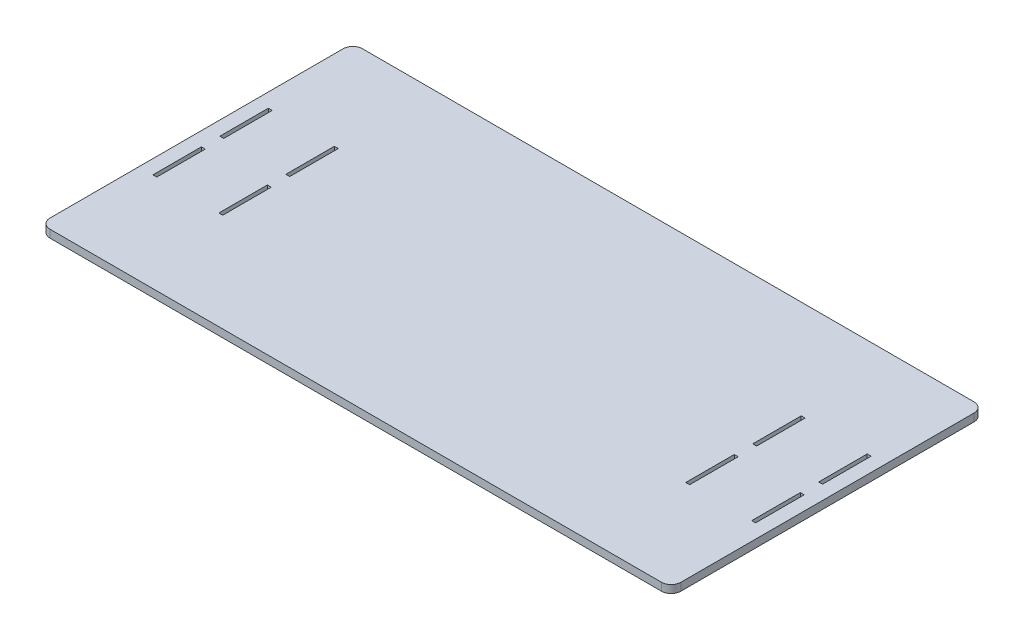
ISO-10303-21;
HEADER;
FILE_DESCRIPTION(('STEP AP214'),'2;1');
FILE_NAME('part.step','',(''),(''),'','','');
FILE_SCHEMA(('AUTOMOTIVE_DESIGN { 1 0 10303 214 1 1 1 1 }'));
ENDSEC;
DATA;
#1=APPLICATION_CONTEXT('core data for automotive mechanical design processes');
#2=APPLICATION_PROTOCOL_DEFINITION('international standard','automotive_design',2000,#1);
#3=PRODUCT_CONTEXT('',#1,'mechanical');
#4=PRODUCT('Part','Part','',(#3));
#5=PRODUCT_RELATED_PRODUCT_CATEGORY('part','',(#4));
#6=PRODUCT_DEFINITION_FORMATION('','',#4);
#7=PRODUCT_DEFINITION_CONTEXT('part definition',#1,'design');
#8=PRODUCT_DEFINITION('design','',#6,#7);
#9=PRODUCT_DEFINITION_SHAPE('','',#8);
#10=(LENGTH_UNIT() NAMED_UNIT(*) SI_UNIT(.MILLI.,.METRE.));
#11=(NAMED_UNIT(*) PLANE_ANGLE_UNIT() SI_UNIT($,.RADIAN.));
#12=(NAMED_UNIT(*) SI_UNIT($,.STERADIAN.) SOLID_ANGLE_UNIT());
#13=UNCERTAINTY_MEASURE_WITH_UNIT(LENGTH_MEASURE(1.E-05),#10,'distance_accuracy_value','');
#14=(GEOMETRIC_REPRESENTATION_CONTEXT(3) GLOBAL_UNCERTAINTY_ASSIGNED_CONTEXT((#13)) GLOBAL_UNIT_ASSIGNED_CONTEXT((#10,
#11,#12)) REPRESENTATION_CONTEXT('',''));
#15=CARTESIAN_POINT('',(0.,0.,0.));
#16=DIRECTION('',(0.,0.,1.));
#17=DIRECTION('',(1.,0.,0.));
#18=AXIS2_PLACEMENT_3D('',#15,#16,#17);
#19=CARTESIAN_POINT('',(-315.,8.,151.));
#20=DIRECTION('',(0.,1.,0.));
#21=DIRECTION('',(0.,0.,1.));
#22=AXIS2_PLACEMENT_3D('',#19,#20,#21);
#23=PLANE('',#22);
#24=CARTESIAN_POINT('',(-315.,8.,151.));
#25=DIRECTION('',(0.,1.,0.));
#26=DIRECTION('',(0.,0.,1.));
#27=AXIS2_PLACEMENT_3D('',#24,#25,#26);
#28=CIRCLE('',#27,10.);
#29=CARTESIAN_POINT('',(-325.,8.,151.));
#30=VERTEX_POINT('',#29);
#31=CARTESIAN_POINT('',(-315.,8.,161.));
#32=VERTEX_POINT('',#31);
#33=EDGE_CURVE('E543',#30,#32,#28,.T.);
#34=ORIENTED_EDGE('',*,*,#33,.T.);
#35=DIRECTION('',(1.,0.,0.));
#36=VECTOR('',#35,1.);
#37=CARTESIAN_POINT('',(-315.,8.,161.));
#38=LINE('',#37,#36);
#39=CARTESIAN_POINT('',(315.,8.,161.));
#40=VERTEX_POINT('',#39);
#41=EDGE_CURVE('E546',#32,#40,#38,.T.);
#42=ORIENTED_EDGE('',*,*,#41,.T.);
#43=CARTESIAN_POINT('',(315.,8.,151.));
#44=DIRECTION('',(0.,1.,0.));
#45=DIRECTION('',(0.,0.,1.));
#46=AXIS2_PLACEMENT_3D('',#43,#44,#45);
#47=CIRCLE('',#46,10.);
#48=CARTESIAN_POINT('',(325.,8.,151.));
#49=VERTEX_POINT('',#48);
#50=EDGE_CURVE('E549',#40,#49,#47,.T.);
#51=ORIENTED_EDGE('',*,*,#50,.T.);
#52=DIRECTION('',(0.,0.,-1.));
#53=VECTOR('',#52,1.);
#54=CARTESIAN_POINT('',(325.,8.,-151.));
#55=LINE('',#54,#53);
#56=CARTESIAN_POINT('',(325.,8.,-151.));
#57=VERTEX_POINT('',#56);
#58=EDGE_CURVE('E551',#49,#57,#55,.T.);
#59=ORIENTED_EDGE('',*,*,#58,.T.);
#60=CARTESIAN_POINT('',(315.,8.,-151.));
#61=DIRECTION('',(0.,1.,0.));
#62=DIRECTION('',(0.,0.,-1.));
#63=AXIS2_PLACEMENT_3D('',#60,#61,#62);
#64=CIRCLE('',#63,10.);
#65=CARTESIAN_POINT('',(315.,8.,-161.));
#66=VERTEX_POINT('',#65);
#67=EDGE_CURVE('E553',#57,#66,#64,.T.);
#68=ORIENTED_EDGE('',*,*,#67,.T.);
#69=DIRECTION('',(-1.,0.,0.));
#70=VECTOR('',#69,1.);
#71=CARTESIAN_POINT('',(-315.,8.,-161.));
#72=LINE('',#71,#70);
#73=CARTESIAN_POINT('',(-315.,8.,-161.));
#74=VERTEX_POINT('',#73);
#75=EDGE_CURVE('E555',#66,#74,#72,.T.);
#76=ORIENTED_EDGE('',*,*,#75,.T.);
#77=CARTESIAN_POINT('',(-315.,8.,-151.));
#78=DIRECTION('',(0.,1.,0.));
#79=DIRECTION('',(0.,0.,1.));
#80=AXIS2_PLACEMENT_3D('',#77,#78,#79);
#81=CIRCLE('',#80,10.);
#82=CARTESIAN_POINT('',(-325.,8.,-151.));
#83=VERTEX_POINT('',#82);
#84=EDGE_CURVE('E557',#74,#83,#81,.T.);
#85=ORIENTED_EDGE('',*,*,#84,.T.);
#86=DIRECTION('',(0.,0.,1.));
#87=VECTOR('',#86,1.);
#88=CARTESIAN_POINT('',(-325.,8.,-151.));
#89=LINE('',#88,#87);
#90=EDGE_CURVE('E559',#83,#30,#89,.T.);
#91=ORIENTED_EDGE('',*,*,#90,.T.);
#92=EDGE_LOOP('',(#34,#42,#51,#59,#68,#76,#85,#91));
#93=FACE_BOUND('',#92,.T.);
#94=DIRECTION('',(1.,0.,0.));
#95=VECTOR('',#94,1.);
#96=CARTESIAN_POINT('',(-310.5,8.,-9.5));
#97=LINE('',#96,#95);
#98=CARTESIAN_POINT('',(-310.5,8.,-9.5));
#99=VERTEX_POINT('',#98);
#100=CARTESIAN_POINT('',(-306.5,8.,-9.5));
#101=VERTEX_POINT('',#100);
#102=EDGE_CURVE('E514',#99,#101,#97,.T.);
#103=ORIENTED_EDGE('',*,*,#102,.F.);
#104=DIRECTION('',(0.,0.,1.));
#105=VECTOR('',#104,1.);
#106=CARTESIAN_POINT('',(-310.5,8.,-9.5));
#107=LINE('',#106,#105);
#108=CARTESIAN_POINT('',(-310.5,8.,-59.5));
#109=VERTEX_POINT('',#108);
#110=EDGE_CURVE('E512',#109,#99,#107,.T.);
#111=ORIENTED_EDGE('',*,*,#110,.F.);
#112=DIRECTION('',(-1.,0.,0.));
#113=VECTOR('',#112,1.);
#114=CARTESIAN_POINT('',(-310.5,8.,-59.5));
#115=LINE('',#114,#113);
#116=CARTESIAN_POINT('',(-306.5,8.,-59.5));
#117=VERTEX_POINT('',#116);
#118=EDGE_CURVE('E520',#117,#109,#115,.T.);
#119=ORIENTED_EDGE('',*,*,#118,.F.);
#120=DIRECTION('',(0.,0.,-1.));
#121=VECTOR('',#120,1.);
#122=CARTESIAN_POINT('',(-306.5,8.,-9.5));
#123=LINE('',#122,#121);
#124=EDGE_CURVE('E517',#101,#117,#123,.T.);
#125=ORIENTED_EDGE('',*,*,#124,.F.);
#126=EDGE_LOOP('',(#103,#111,#119,#125));
#127=FACE_BOUND('',#126,.T.);
#128=DIRECTION('',(0.,0.,-1.));
#129=VECTOR('',#128,1.);
#130=CARTESIAN_POINT('',(-238.5,8.,-9.50000000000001));
#131=LINE('',#130,#129);
#132=CARTESIAN_POINT('',(-238.5,8.,-9.50000000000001));
#133=VERTEX_POINT('',#132);
#134=CARTESIAN_POINT('',(-238.5,8.,-59.5));
#135=VERTEX_POINT('',#134);
#136=EDGE_CURVE('E483',#133,#135,#131,.T.);
#137=ORIENTED_EDGE('',*,*,#136,.F.);
#138=DIRECTION('',(1.,0.,0.));
#139=VECTOR('',#138,1.);
#140=CARTESIAN_POINT('',(-238.5,8.,-9.50000000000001));
#141=LINE('',#140,#139);
#142=CARTESIAN_POINT('',(-242.5,8.,-9.50000000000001));
#143=VERTEX_POINT('',#142);
#144=EDGE_CURVE('E481',#143,#133,#141,.T.);
#145=ORIENTED_EDGE('',*,*,#144,.F.);
#146=DIRECTION('',(0.,0.,1.));
#147=VECTOR('',#146,1.);
#148=CARTESIAN_POINT('',(-242.5,8.,-9.50000000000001));
#149=LINE('',#148,#147);
#150=CARTESIAN_POINT('',(-242.5,8.,-59.5));
#151=VERTEX_POINT('',#150);
#152=EDGE_CURVE('E489',#151,#143,#149,.T.);
#153=ORIENTED_EDGE('',*,*,#152,.F.);
#154=DIRECTION('',(-1.,0.,0.));
#155=VECTOR('',#154,1.);
#156=CARTESIAN_POINT('',(-238.5,8.,-59.5));
#157=LINE('',#156,#155);
#158=EDGE_CURVE('E486',#135,#151,#157,.T.);
#159=ORIENTED_EDGE('',*,*,#158,.F.);
#160=EDGE_LOOP('',(#137,#145,#153,#159));
#161=FACE_BOUND('',#160,.T.);
#162=DIRECTION('',(-1.,0.,0.));
#163=VECTOR('',#162,1.);
#164=CARTESIAN_POINT('',(-238.5,8.,9.50000000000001));
#165=LINE('',#164,#163);
#166=CARTESIAN_POINT('',(-238.5,8.,9.50000000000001));
#167=VERTEX_POINT('',#166);
#168=CARTESIAN_POINT('',(-242.5,8.,9.50000000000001));
#169=VERTEX_POINT('',#168);
#170=EDGE_CURVE('E452',#167,#169,#165,.T.);
#171=ORIENTED_EDGE('',*,*,#170,.F.);
#172=DIRECTION('',(0.,0.,-1.));
#173=VECTOR('',#172,1.);
#174=CARTESIAN_POINT('',(-238.5,8.,9.50000000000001));
#175=LINE('',#174,#173);
#176=CARTESIAN_POINT('',(-238.5,8.,59.5));
#177=VERTEX_POINT('',#176);
#178=EDGE_CURVE('E450',#177,#167,#175,.T.);
#179=ORIENTED_EDGE('',*,*,#178,.F.);
#180=DIRECTION('',(1.,0.,0.));
#181=VECTOR('',#180,1.);
#182=CARTESIAN_POINT('',(-238.5,8.,59.5));
#183=LINE('',#182,#181);
#184=CARTESIAN_POINT('',(-242.5,8.,59.5));
#185=VERTEX_POINT('',#184);
#186=EDGE_CURVE('E458',#185,#177,#183,.T.);
#187=ORIENTED_EDGE('',*,*,#186,.F.);
#188=DIRECTION('',(0.,0.,1.));
#189=VECTOR('',#188,1.);
#190=CARTESIAN_POINT('',(-242.5,8.,9.50000000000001));
#191=LINE('',#190,#189);
#192=EDGE_CURVE('E455',#169,#185,#191,.T.);
#193=ORIENTED_EDGE('',*,*,#192,.F.);
#194=EDGE_LOOP('',(#171,#179,#187,#193));
#195=FACE_BOUND('',#194,.T.);
#196=DIRECTION('',(0.,0.,1.));
#197=VECTOR('',#196,1.);
#198=CARTESIAN_POINT('',(-310.5,8.,9.50000000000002));
#199=LINE('',#198,#197);
#200=CARTESIAN_POINT('',(-310.5,8.,9.50000000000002));
#201=VERTEX_POINT('',#200);
#202=CARTESIAN_POINT('',(-310.5,8.,59.5));
#203=VERTEX_POINT('',#202);
#204=EDGE_CURVE('E421',#201,#203,#199,.T.);
#205=ORIENTED_EDGE('',*,*,#204,.F.);
#206=DIRECTION('',(-1.,0.,0.));
#207=VECTOR('',#206,1.);
#208=CARTESIAN_POINT('',(-310.5,8.,9.50000000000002));
#209=LINE('',#208,#207);
#210=CARTESIAN_POINT('',(-306.5,8.,9.50000000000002));
#211=VERTEX_POINT('',#210);
#212=EDGE_CURVE('E419',#211,#201,#209,.T.);
#213=ORIENTED_EDGE('',*,*,#212,.F.);
#214=DIRECTION('',(0.,0.,-1.));
#215=VECTOR('',#214,1.);
#216=CARTESIAN_POINT('',(-306.5,8.,9.50000000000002));
#217=LINE('',#216,#215);
#218=CARTESIAN_POINT('',(-306.5,8.,59.5));
#219=VERTEX_POINT('',#218);
#220=EDGE_CURVE('E427',#219,#211,#217,.T.);
#221=ORIENTED_EDGE('',*,*,#220,.F.);
#222=DIRECTION('',(1.,0.,0.));
#223=VECTOR('',#222,1.);
#224=CARTESIAN_POINT('',(-310.5,8.,59.5));
#225=LINE('',#224,#223);
#226=EDGE_CURVE('E424',#203,#219,#225,.T.);
#227=ORIENTED_EDGE('',*,*,#226,.F.);
#228=EDGE_LOOP('',(#205,#213,#221,#227));
#229=FACE_BOUND('',#228,.T.);
#230=DIRECTION('',(-1.,0.,0.));
#231=VECTOR('',#230,1.);
#232=CARTESIAN_POINT('',(310.5,8.,9.49999999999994));
#233=LINE('',#232,#231);
#234=CARTESIAN_POINT('',(310.5,8.,9.49999999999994));
#235=VERTEX_POINT('',#234);
#236=CARTESIAN_POINT('',(306.5,8.,9.49999999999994));
#237=VERTEX_POINT('',#236);
#238=EDGE_CURVE('E390',#235,#237,#233,.T.);
#239=ORIENTED_EDGE('',*,*,#238,.F.);
#240=DIRECTION('',(0.,0.,-1.));
#241=VECTOR('',#240,1.);
#242=CARTESIAN_POINT('',(310.5,8.,9.49999999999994));
#243=LINE('',#242,#241);
#244=CARTESIAN_POINT('',(310.5,8.,59.4999999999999));
#245=VERTEX_POINT('',#244);
#246=EDGE_CURVE('E388',#245,#235,#243,.T.);
#247=ORIENTED_EDGE('',*,*,#246,.F.);
#248=DIRECTION('',(1.,0.,0.));
#249=VECTOR('',#248,1.);
#250=CARTESIAN_POINT('',(310.5,8.,59.4999999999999));
#251=LINE('',#250,#249);
#252=CARTESIAN_POINT('',(306.5,8.,59.4999999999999));
#253=VERTEX_POINT('',#252);
#254=EDGE_CURVE('E396',#253,#245,#251,.T.);
#255=ORIENTED_EDGE('',*,*,#254,.F.);
#256=DIRECTION('',(0.,0.,1.));
#257=VECTOR('',#256,1.);
#258=CARTESIAN_POINT('',(306.5,8.,9.49999999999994));
#259=LINE('',#258,#257);
#260=EDGE_CURVE('E393',#237,#253,#259,.T.);
#261=ORIENTED_EDGE('',*,*,#260,.F.);
#262=EDGE_LOOP('',(#239,#247,#255,#261));
#263=FACE_BOUND('',#262,.T.);
#264=DIRECTION('',(0.,0.,1.));
#265=VECTOR('',#264,1.);
#266=CARTESIAN_POINT('',(238.5,8.,9.49999999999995));
#267=LINE('',#266,#265);
#268=CARTESIAN_POINT('',(238.5,8.,9.49999999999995));
#269=VERTEX_POINT('',#268);
#270=CARTESIAN_POINT('',(238.5,8.,59.5));
#271=VERTEX_POINT('',#270);
#272=EDGE_CURVE('E359',#269,#271,#267,.T.);
#273=ORIENTED_EDGE('',*,*,#272,.F.);
#274=DIRECTION('',(-1.,0.,0.));
#275=VECTOR('',#274,1.);
#276=CARTESIAN_POINT('',(238.5,8.,9.49999999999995));
#277=LINE('',#276,#275);
#278=CARTESIAN_POINT('',(242.5,8.,9.49999999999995));
#279=VERTEX_POINT('',#278);
#280=EDGE_CURVE('E357',#279,#269,#277,.T.);
#281=ORIENTED_EDGE('',*,*,#280,.F.);
#282=DIRECTION('',(0.,0.,-1.));
#283=VECTOR('',#282,1.);
#284=CARTESIAN_POINT('',(242.5,8.,9.49999999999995));
#285=LINE('',#284,#283);
#286=CARTESIAN_POINT('',(242.5,8.,59.4999999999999));
#287=VERTEX_POINT('',#286);
#288=EDGE_CURVE('E365',#287,#279,#285,.T.);
#289=ORIENTED_EDGE('',*,*,#288,.F.);
#290=DIRECTION('',(1.,0.,0.));
#291=VECTOR('',#290,1.);
#292=CARTESIAN_POINT('',(238.5,8.,59.5));
#293=LINE('',#292,#291);
#294=EDGE_CURVE('E362',#271,#287,#293,.T.);
#295=ORIENTED_EDGE('',*,*,#294,.F.);
#296=EDGE_LOOP('',(#273,#281,#289,#295));
#297=FACE_BOUND('',#296,.T.);
#298=DIRECTION('',(1.,0.,0.));
#299=VECTOR('',#298,1.);
#300=CARTESIAN_POINT('',(238.5,8.,-9.49999999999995));
#301=LINE('',#300,#299);
#302=CARTESIAN_POINT('',(238.5,8.,-9.49999999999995));
#303=VERTEX_POINT('',#302);
#304=CARTESIAN_POINT('',(242.5,8.,-9.49999999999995));
#305=VERTEX_POINT('',#304);
#306=EDGE_CURVE('E328',#303,#305,#301,.T.);
#307=ORIENTED_EDGE('',*,*,#306,.F.);
#308=DIRECTION('',(0.,0.,1.));
#309=VECTOR('',#308,1.);
#310=CARTESIAN_POINT('',(238.5,8.,-9.49999999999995));
#311=LINE('',#310,#309);
#312=CARTESIAN_POINT('',(238.5,8.,-59.5));
#313=VERTEX_POINT('',#312);
#314=EDGE_CURVE('E326',#313,#303,#311,.T.);
#315=ORIENTED_EDGE('',*,*,#314,.F.);
#316=DIRECTION('',(-1.,0.,0.));
#317=VECTOR('',#316,1.);
#318=CARTESIAN_POINT('',(238.5,8.,-59.5));
#319=LINE('',#318,#317);
#320=CARTESIAN_POINT('',(242.5,8.,-59.5));
#321=VERTEX_POINT('',#320);
#322=EDGE_CURVE('E334',#321,#313,#319,.T.);
#323=ORIENTED_EDGE('',*,*,#322,.F.);
#324=DIRECTION('',(0.,0.,-1.));
#325=VECTOR('',#324,1.);
#326=CARTESIAN_POINT('',(242.5,8.,-9.49999999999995));
#327=LINE('',#326,#325);
#328=EDGE_CURVE('E331',#305,#321,#327,.T.);
#329=ORIENTED_EDGE('',*,*,#328,.F.);
#330=EDGE_LOOP('',(#307,#315,#323,#329));
#331=FACE_BOUND('',#330,.T.);
#332=DIRECTION('',(0.,0.,-1.));
#333=VECTOR('',#332,1.);
#334=CARTESIAN_POINT('',(310.5,8.,-9.49999999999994));
#335=LINE('',#334,#333);
#336=CARTESIAN_POINT('',(310.5,8.,-9.49999999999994));
#337=VERTEX_POINT('',#336);
#338=CARTESIAN_POINT('',(310.5,8.,-59.4999999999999));
#339=VERTEX_POINT('',#338);
#340=EDGE_CURVE('E298',#337,#339,#335,.T.);
#341=ORIENTED_EDGE('',*,*,#340,.F.);
#342=DIRECTION('',(1.,0.,0.));
#343=VECTOR('',#342,1.);
#344=CARTESIAN_POINT('',(310.5,8.,-9.49999999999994));
#345=LINE('',#344,#343);
#346=CARTESIAN_POINT('',(306.5,8.,-9.49999999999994));
#347=VERTEX_POINT('',#346);
#348=EDGE_CURVE('E290',#347,#337,#345,.T.);
#349=ORIENTED_EDGE('',*,*,#348,.F.);
#350=DIRECTION('',(0.,0.,1.));
#351=VECTOR('',#350,1.);
#352=CARTESIAN_POINT('',(306.5,8.,-9.49999999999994));
#353=LINE('',#352,#351);
#354=CARTESIAN_POINT('',(306.5,8.,-59.4999999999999));
#355=VERTEX_POINT('',#354);
#356=EDGE_CURVE('E312',#355,#347,#353,.T.);
#357=ORIENTED_EDGE('',*,*,#356,.F.);
#358=DIRECTION('',(-1.,0.,0.));
#359=VECTOR('',#358,1.);
#360=CARTESIAN_POINT('',(310.5,8.,-59.4999999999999));
#361=LINE('',#360,#359);
#362=EDGE_CURVE('E310',#339,#355,#361,.T.);
#363=ORIENTED_EDGE('',*,*,#362,.F.);
#364=EDGE_LOOP('',(#341,#349,#357,#363));
#365=FACE_BOUND('',#364,.T.);
#366=ADVANCED_FACE('F33',(#93,#127,#161,#195,#229,#263,#297,#331,#365),#23,.T.);
#367=CARTESIAN_POINT('',(-315.,0.,151.));
#368=DIRECTION('',(0.,1.,0.));
#369=DIRECTION('',(0.,0.,1.));
#370=AXIS2_PLACEMENT_3D('',#367,#368,#369);
#371=PLANE('',#370);
#372=DIRECTION('',(0.,0.,1.));
#373=VECTOR('',#372,1.);
#374=CARTESIAN_POINT('',(238.5,0.,-9.49999999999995));
#375=LINE('',#374,#373);
#376=CARTESIAN_POINT('',(238.5,0.,-59.5));
#377=VERTEX_POINT('',#376);
#378=CARTESIAN_POINT('',(238.5,0.,-9.49999999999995));
#379=VERTEX_POINT('',#378);
#380=EDGE_CURVE('E306',#377,#379,#375,.T.);
#381=ORIENTED_EDGE('',*,*,#380,.T.);
#382=DIRECTION('',(1.,0.,0.));
#383=VECTOR('',#382,1.);
#384=CARTESIAN_POINT('',(238.5,0.,-9.49999999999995));
#385=LINE('',#384,#383);
#386=CARTESIAN_POINT('',(242.5,0.,-9.49999999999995));
#387=VERTEX_POINT('',#386);
#388=EDGE_CURVE('E339',#379,#387,#385,.T.);
#389=ORIENTED_EDGE('',*,*,#388,.T.);
#390=DIRECTION('',(0.,0.,-1.));
#391=VECTOR('',#390,1.);
#392=CARTESIAN_POINT('',(242.5,0.,-9.49999999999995));
#393=LINE('',#392,#391);
#394=CARTESIAN_POINT('',(242.5,0.,-59.5));
#395=VERTEX_POINT('',#394);
#396=EDGE_CURVE('E342',#387,#395,#393,.T.);
#397=ORIENTED_EDGE('',*,*,#396,.T.);
#398=DIRECTION('',(-1.,0.,0.));
#399=VECTOR('',#398,1.);
#400=CARTESIAN_POINT('',(238.5,0.,-59.5));
#401=LINE('',#400,#399);
#402=EDGE_CURVE('E329',#395,#377,#401,.T.);
#403=ORIENTED_EDGE('',*,*,#402,.T.);
#404=EDGE_LOOP('',(#381,#389,#397,#403));
#405=FACE_BOUND('',#404,.T.);
#406=DIRECTION('',(0.,0.,-1.));
#407=VECTOR('',#406,1.);
#408=CARTESIAN_POINT('',(310.5,0.,9.49999999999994));
#409=LINE('',#408,#407);
#410=CARTESIAN_POINT('',(310.5,0.,59.4999999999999));
#411=VERTEX_POINT('',#410);
#412=CARTESIAN_POINT('',(310.5,0.,9.49999999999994));
#413=VERTEX_POINT('',#412);
#414=EDGE_CURVE('E387',#411,#413,#409,.T.);
#415=ORIENTED_EDGE('',*,*,#414,.T.);
#416=DIRECTION('',(-1.,0.,0.));
#417=VECTOR('',#416,1.);
#418=CARTESIAN_POINT('',(310.5,0.,9.49999999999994));
#419=LINE('',#418,#417);
#420=CARTESIAN_POINT('',(306.5,0.,9.49999999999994));
#421=VERTEX_POINT('',#420);
#422=EDGE_CURVE('E401',#413,#421,#419,.T.);
#423=ORIENTED_EDGE('',*,*,#422,.T.);
#424=DIRECTION('',(0.,0.,1.));
#425=VECTOR('',#424,1.);
#426=CARTESIAN_POINT('',(306.5,0.,9.49999999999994));
#427=LINE('',#426,#425);
#428=CARTESIAN_POINT('',(306.5,0.,59.4999999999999));
#429=VERTEX_POINT('',#428);
#430=EDGE_CURVE('E404',#421,#429,#427,.T.);
#431=ORIENTED_EDGE('',*,*,#430,.T.);
#432=DIRECTION('',(1.,0.,0.));
#433=VECTOR('',#432,1.);
#434=CARTESIAN_POINT('',(310.5,0.,59.4999999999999));
#435=LINE('',#434,#433);
#436=EDGE_CURVE('E391',#429,#411,#435,.T.);
#437=ORIENTED_EDGE('',*,*,#436,.T.);
#438=EDGE_LOOP('',(#415,#423,#431,#437));
#439=FACE_BOUND('',#438,.T.);
#440=DIRECTION('',(0.,0.,-1.));
#441=VECTOR('',#440,1.);
#442=CARTESIAN_POINT('',(-238.5,0.,9.50000000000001));
#443=LINE('',#442,#441);
#444=CARTESIAN_POINT('',(-238.5,0.,59.5));
#445=VERTEX_POINT('',#444);
#446=CARTESIAN_POINT('',(-238.5,0.,9.50000000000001));
#447=VERTEX_POINT('',#446);
#448=EDGE_CURVE('E449',#445,#447,#443,.T.);
#449=ORIENTED_EDGE('',*,*,#448,.T.);
#450=DIRECTION('',(-1.,0.,0.));
#451=VECTOR('',#450,1.);
#452=CARTESIAN_POINT('',(-238.5,0.,9.50000000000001));
#453=LINE('',#452,#451);
#454=CARTESIAN_POINT('',(-242.5,0.,9.50000000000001));
#455=VERTEX_POINT('',#454);
#456=EDGE_CURVE('E463',#447,#455,#453,.T.);
#457=ORIENTED_EDGE('',*,*,#456,.T.);
#458=DIRECTION('',(0.,0.,1.));
#459=VECTOR('',#458,1.);
#460=CARTESIAN_POINT('',(-242.5,0.,9.50000000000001));
#461=LINE('',#460,#459);
#462=CARTESIAN_POINT('',(-242.5,0.,59.5));
#463=VERTEX_POINT('',#462);
#464=EDGE_CURVE('E466',#455,#463,#461,.T.);
#465=ORIENTED_EDGE('',*,*,#464,.T.);
#466=DIRECTION('',(1.,0.,0.));
#467=VECTOR('',#466,1.);
#468=CARTESIAN_POINT('',(-238.5,0.,59.5));
#469=LINE('',#468,#467);
#470=EDGE_CURVE('E453',#463,#445,#469,.T.);
#471=ORIENTED_EDGE('',*,*,#470,.T.);
#472=EDGE_LOOP('',(#449,#457,#465,#471));
#473=FACE_BOUND('',#472,.T.);
#474=DIRECTION('',(0.,0.,1.));
#475=VECTOR('',#474,1.);
#476=CARTESIAN_POINT('',(-310.5,0.,-9.5));
#477=LINE('',#476,#475);
#478=CARTESIAN_POINT('',(-310.5,0.,-59.5));
#479=VERTEX_POINT('',#478);
#480=CARTESIAN_POINT('',(-310.5,0.,-9.5));
#481=VERTEX_POINT('',#480);
#482=EDGE_CURVE('E511',#479,#481,#477,.T.);
#483=ORIENTED_EDGE('',*,*,#482,.T.);
#484=DIRECTION('',(1.,0.,0.));
#485=VECTOR('',#484,1.);
#486=CARTESIAN_POINT('',(-310.5,0.,-9.5));
#487=LINE('',#486,#485);
#488=CARTESIAN_POINT('',(-306.5,0.,-9.5));
#489=VERTEX_POINT('',#488);
#490=EDGE_CURVE('E525',#481,#489,#487,.T.);
#491=ORIENTED_EDGE('',*,*,#490,.T.);
#492=DIRECTION('',(0.,0.,-1.));
#493=VECTOR('',#492,1.);
#494=CARTESIAN_POINT('',(-306.5,0.,-9.5));
#495=LINE('',#494,#493);
#496=CARTESIAN_POINT('',(-306.5,0.,-59.5));
#497=VERTEX_POINT('',#496);
#498=EDGE_CURVE('E528',#489,#497,#495,.T.);
#499=ORIENTED_EDGE('',*,*,#498,.T.);
#500=DIRECTION('',(-1.,0.,0.));
#501=VECTOR('',#500,1.);
#502=CARTESIAN_POINT('',(-310.5,0.,-59.5));
#503=LINE('',#502,#501);
#504=EDGE_CURVE('E515',#497,#479,#503,.T.);
#505=ORIENTED_EDGE('',*,*,#504,.T.);
#506=EDGE_LOOP('',(#483,#491,#499,#505));
#507=FACE_BOUND('',#506,.T.);
#508=CARTESIAN_POINT('',(-315.,0.,151.));
#509=DIRECTION('',(0.,1.,0.));
#510=DIRECTION('',(0.,0.,1.));
#511=AXIS2_PLACEMENT_3D('',#508,#509,#510);
#512=CIRCLE('',#511,10.);
#513=CARTESIAN_POINT('',(-325.,0.,151.));
#514=VERTEX_POINT('',#513);
#515=CARTESIAN_POINT('',(-315.,0.,161.));
#516=VERTEX_POINT('',#515);
#517=EDGE_CURVE('E542',#514,#516,#512,.T.);
#518=ORIENTED_EDGE('',*,*,#517,.F.);
#519=DIRECTION('',(0.,0.,1.));
#520=VECTOR('',#519,1.);
#521=CARTESIAN_POINT('',(-325.,0.,-151.));
#522=LINE('',#521,#520);
#523=CARTESIAN_POINT('',(-325.,0.,-151.));
#524=VERTEX_POINT('',#523);
#525=EDGE_CURVE('E547',#524,#514,#522,.T.);
#526=ORIENTED_EDGE('',*,*,#525,.F.);
#527=CARTESIAN_POINT('',(-315.,0.,-151.));
#528=DIRECTION('',(0.,1.,0.));
#529=DIRECTION('',(0.,0.,1.));
#530=AXIS2_PLACEMENT_3D('',#527,#528,#529);
#531=CIRCLE('',#530,10.);
#532=CARTESIAN_POINT('',(-315.,0.,-161.));
#533=VERTEX_POINT('',#532);
#534=EDGE_CURVE('E574',#533,#524,#531,.T.);
#535=ORIENTED_EDGE('',*,*,#534,.F.);
#536=DIRECTION('',(-1.,0.,0.));
#537=VECTOR('',#536,1.);
#538=CARTESIAN_POINT('',(-315.,0.,-161.));
#539=LINE('',#538,#537);
#540=CARTESIAN_POINT('',(315.,0.,-161.));
#541=VERTEX_POINT('',#540);
#542=EDGE_CURVE('E572',#541,#533,#539,.T.);
#543=ORIENTED_EDGE('',*,*,#542,.F.);
#544=CARTESIAN_POINT('',(315.,0.,-151.));
#545=DIRECTION('',(0.,1.,0.));
#546=DIRECTION('',(0.,0.,-1.));
#547=AXIS2_PLACEMENT_3D('',#544,#545,#546);
#548=CIRCLE('',#547,10.);
#549=CARTESIAN_POINT('',(325.,0.,-151.));
#550=VERTEX_POINT('',#549);
#551=EDGE_CURVE('E570',#550,#541,#548,.T.);
#552=ORIENTED_EDGE('',*,*,#551,.F.);
#553=DIRECTION('',(0.,0.,-1.));
#554=VECTOR('',#553,1.);
#555=CARTESIAN_POINT('',(325.,0.,-151.));
#556=LINE('',#555,#554);
#557=CARTESIAN_POINT('',(325.,0.,151.));
#558=VERTEX_POINT('',#557);
#559=EDGE_CURVE('E568',#558,#550,#556,.T.);
#560=ORIENTED_EDGE('',*,*,#559,.F.);
#561=CARTESIAN_POINT('',(315.,0.,151.));
#562=DIRECTION('',(0.,1.,0.));
#563=DIRECTION('',(0.,0.,1.));
#564=AXIS2_PLACEMENT_3D('',#561,#562,#563);
#565=CIRCLE('',#564,10.);
#566=CARTESIAN_POINT('',(315.,0.,161.));
#567=VERTEX_POINT('',#566);
#568=EDGE_CURVE('E566',#567,#558,#565,.T.);
#569=ORIENTED_EDGE('',*,*,#568,.F.);
#570=DIRECTION('',(1.,0.,0.));
#571=VECTOR('',#570,1.);
#572=CARTESIAN_POINT('',(-315.,0.,161.));
#573=LINE('',#572,#571);
#574=EDGE_CURVE('E564',#516,#567,#573,.T.);
#575=ORIENTED_EDGE('',*,*,#574,.F.);
#576=EDGE_LOOP('',(#518,#526,#535,#543,#552,#560,#569,#575));
#577=FACE_BOUND('',#576,.T.);
#578=DIRECTION('',(1.,0.,0.));
#579=VECTOR('',#578,1.);
#580=CARTESIAN_POINT('',(-238.5,0.,-9.50000000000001));
#581=LINE('',#580,#579);
#582=CARTESIAN_POINT('',(-242.5,0.,-9.50000000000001));
#583=VERTEX_POINT('',#582);
#584=CARTESIAN_POINT('',(-238.5,0.,-9.50000000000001));
#585=VERTEX_POINT('',#584);
#586=EDGE_CURVE('E480',#583,#585,#581,.T.);
#587=ORIENTED_EDGE('',*,*,#586,.T.);
#588=DIRECTION('',(0.,0.,-1.));
#589=VECTOR('',#588,1.);
#590=CARTESIAN_POINT('',(-238.5,0.,-9.50000000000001));
#591=LINE('',#590,#589);
#592=CARTESIAN_POINT('',(-238.5,0.,-59.5));
#593=VERTEX_POINT('',#592);
#594=EDGE_CURVE('E494',#585,#593,#591,.T.);
#595=ORIENTED_EDGE('',*,*,#594,.T.);
#596=DIRECTION('',(-1.,0.,0.));
#597=VECTOR('',#596,1.);
#598=CARTESIAN_POINT('',(-238.5,0.,-59.5));
#599=LINE('',#598,#597);
#600=CARTESIAN_POINT('',(-242.5,0.,-59.5));
#601=VERTEX_POINT('',#600);
#602=EDGE_CURVE('E497',#593,#601,#599,.T.);
#603=ORIENTED_EDGE('',*,*,#602,.T.);
#604=DIRECTION('',(0.,0.,1.));
#605=VECTOR('',#604,1.);
#606=CARTESIAN_POINT('',(-242.5,0.,-9.50000000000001));
#607=LINE('',#606,#605);
#608=EDGE_CURVE('E484',#601,#583,#607,.T.);
#609=ORIENTED_EDGE('',*,*,#608,.T.);
#610=EDGE_LOOP('',(#587,#595,#603,#609));
#611=FACE_BOUND('',#610,.T.);
#612=DIRECTION('',(-1.,0.,0.));
#613=VECTOR('',#612,1.);
#614=CARTESIAN_POINT('',(-310.5,0.,9.50000000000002));
#615=LINE('',#614,#613);
#616=CARTESIAN_POINT('',(-306.5,0.,9.50000000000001));
#617=VERTEX_POINT('',#616);
#618=CARTESIAN_POINT('',(-310.5,0.,9.50000000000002));
#619=VERTEX_POINT('',#618);
#620=EDGE_CURVE('E418',#617,#619,#615,.T.);
#621=ORIENTED_EDGE('',*,*,#620,.T.);
#622=DIRECTION('',(0.,0.,1.));
#623=VECTOR('',#622,1.);
#624=CARTESIAN_POINT('',(-310.5,0.,9.50000000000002));
#625=LINE('',#624,#623);
#626=CARTESIAN_POINT('',(-310.5,0.,59.5));
#627=VERTEX_POINT('',#626);
#628=EDGE_CURVE('E432',#619,#627,#625,.T.);
#629=ORIENTED_EDGE('',*,*,#628,.T.);
#630=DIRECTION('',(1.,0.,0.));
#631=VECTOR('',#630,1.);
#632=CARTESIAN_POINT('',(-310.5,0.,59.5));
#633=LINE('',#632,#631);
#634=CARTESIAN_POINT('',(-306.5,0.,59.5));
#635=VERTEX_POINT('',#634);
#636=EDGE_CURVE('E435',#627,#635,#633,.T.);
#637=ORIENTED_EDGE('',*,*,#636,.T.);
#638=DIRECTION('',(0.,0.,-1.));
#639=VECTOR('',#638,1.);
#640=CARTESIAN_POINT('',(-306.5,0.,9.50000000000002));
#641=LINE('',#640,#639);
#642=EDGE_CURVE('E422',#635,#617,#641,.T.);
#643=ORIENTED_EDGE('',*,*,#642,.T.);
#644=EDGE_LOOP('',(#621,#629,#637,#643));
#645=FACE_BOUND('',#644,.T.);
#646=DIRECTION('',(-1.,0.,0.));
#647=VECTOR('',#646,1.);
#648=CARTESIAN_POINT('',(238.5,0.,9.49999999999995));
#649=LINE('',#648,#647);
#650=CARTESIAN_POINT('',(242.5,0.,9.49999999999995));
#651=VERTEX_POINT('',#650);
#652=CARTESIAN_POINT('',(238.5,0.,9.49999999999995));
#653=VERTEX_POINT('',#652);
#654=EDGE_CURVE('E356',#651,#653,#649,.T.);
#655=ORIENTED_EDGE('',*,*,#654,.T.);
#656=DIRECTION('',(0.,0.,1.));
#657=VECTOR('',#656,1.);
#658=CARTESIAN_POINT('',(238.5,0.,9.49999999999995));
#659=LINE('',#658,#657);
#660=CARTESIAN_POINT('',(238.5,0.,59.5));
#661=VERTEX_POINT('',#660);
#662=EDGE_CURVE('E370',#653,#661,#659,.T.);
#663=ORIENTED_EDGE('',*,*,#662,.T.);
#664=DIRECTION('',(1.,0.,0.));
#665=VECTOR('',#664,1.);
#666=CARTESIAN_POINT('',(238.5,0.,59.5));
#667=LINE('',#666,#665);
#668=CARTESIAN_POINT('',(242.5,0.,59.5));
#669=VERTEX_POINT('',#668);
#670=EDGE_CURVE('E373',#661,#669,#667,.T.);
#671=ORIENTED_EDGE('',*,*,#670,.T.);
#672=DIRECTION('',(0.,0.,-1.));
#673=VECTOR('',#672,1.);
#674=CARTESIAN_POINT('',(242.5,0.,9.49999999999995));
#675=LINE('',#674,#673);
#676=EDGE_CURVE('E360',#669,#651,#675,.T.);
#677=ORIENTED_EDGE('',*,*,#676,.T.);
#678=EDGE_LOOP('',(#655,#663,#671,#677));
#679=FACE_BOUND('',#678,.T.);
#680=DIRECTION('',(1.,0.,0.));
#681=VECTOR('',#680,1.);
#682=CARTESIAN_POINT('',(310.5,0.,-9.49999999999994));
#683=LINE('',#682,#681);
#684=CARTESIAN_POINT('',(306.5,0.,-9.49999999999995));
#685=VERTEX_POINT('',#684);
#686=CARTESIAN_POINT('',(310.5,0.,-9.49999999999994));
#687=VERTEX_POINT('',#686);
#688=EDGE_CURVE('E56',#685,#687,#683,.T.);
#689=ORIENTED_EDGE('',*,*,#688,.T.);
#690=DIRECTION('',(0.,0.,-1.));
#691=VECTOR('',#690,1.);
#692=CARTESIAN_POINT('',(310.5,0.,-9.49999999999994));
#693=LINE('',#692,#691);
#694=CARTESIAN_POINT('',(310.5,0.,-59.4999999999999));
#695=VERTEX_POINT('',#694);
#696=EDGE_CURVE('E305',#687,#695,#693,.T.);
#697=ORIENTED_EDGE('',*,*,#696,.T.);
#698=DIRECTION('',(-1.,0.,0.));
#699=VECTOR('',#698,1.);
#700=CARTESIAN_POINT('',(310.5,0.,-59.4999999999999));
#701=LINE('',#700,#699);
#702=CARTESIAN_POINT('',(306.5,0.,-59.4999999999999));
#703=VERTEX_POINT('',#702);
#704=EDGE_CURVE('E318',#695,#703,#701,.T.);
#705=ORIENTED_EDGE('',*,*,#704,.T.);
#706=DIRECTION('',(0.,0.,1.));
#707=VECTOR('',#706,1.);
#708=CARTESIAN_POINT('',(306.5,0.,-9.49999999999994));
#709=LINE('',#708,#707);
#710=EDGE_CURVE('E299',#703,#685,#709,.T.);
#711=ORIENTED_EDGE('',*,*,#710,.T.);
#712=EDGE_LOOP('',(#689,#697,#705,#711));
#713=FACE_BOUND('',#712,.T.);
#714=ADVANCED_FACE('F604',(#405,#439,#473,#507,#577,#611,#645,#679,#713),#371,.F.);
#715=CARTESIAN_POINT('',(-315.,8.,151.));
#716=DIRECTION('',(0.,-1.,0.));
#717=DIRECTION('',(0.,0.,-1.));
#718=AXIS2_PLACEMENT_3D('',#715,#716,#717);
#719=CYLINDRICAL_SURFACE('',#718,10.);
#720=ORIENTED_EDGE('',*,*,#517,.T.);
#721=DIRECTION('',(0.,-1.,0.));
#722=VECTOR('',#721,1.);
#723=CARTESIAN_POINT('',(-315.,8.,161.));
#724=LINE('',#723,#722);
#725=EDGE_CURVE('E11',#32,#516,#724,.T.);
#726=ORIENTED_EDGE('',*,*,#725,.F.);
#727=ORIENTED_EDGE('',*,*,#33,.F.);
#728=DIRECTION('',(0.,-1.,0.));
#729=VECTOR('',#728,1.);
#730=CARTESIAN_POINT('',(-325.,8.,151.));
#731=LINE('',#730,#729);
#732=EDGE_CURVE('E561',#30,#514,#731,.T.);
#733=ORIENTED_EDGE('',*,*,#732,.T.);
#734=EDGE_LOOP('',(#720,#726,#727,#733));
#735=FACE_BOUND('',#734,.T.);
#736=ADVANCED_FACE('F35',(#735),#719,.T.);
#737=CARTESIAN_POINT('',(-315.,8.,161.));
#738=DIRECTION('',(0.,0.,-1.));
#739=DIRECTION('',(-1.,0.,0.));
#740=AXIS2_PLACEMENT_3D('',#737,#738,#739);
#741=PLANE('',#740);
#742=ORIENTED_EDGE('',*,*,#574,.T.);
#743=DIRECTION('',(0.,-1.,0.));
#744=VECTOR('',#743,1.);
#745=CARTESIAN_POINT('',(315.,8.,161.));
#746=LINE('',#745,#744);
#747=EDGE_CURVE('E41',#40,#567,#746,.T.);
#748=ORIENTED_EDGE('',*,*,#747,.F.);
#749=ORIENTED_EDGE('',*,*,#41,.F.);
#750=ORIENTED_EDGE('',*,*,#725,.T.);
#751=EDGE_LOOP('',(#742,#748,#749,#750));
#752=FACE_BOUND('',#751,.T.);
#753=ADVANCED_FACE('F622',(#752),#741,.F.);
#754=CARTESIAN_POINT('',(315.,8.,151.));
#755=DIRECTION('',(0.,-1.,0.));
#756=DIRECTION('',(0.,0.,-1.));
#757=AXIS2_PLACEMENT_3D('',#754,#755,#756);
#758=CYLINDRICAL_SURFACE('',#757,10.);
#759=ORIENTED_EDGE('',*,*,#568,.T.);
#760=DIRECTION('',(0.,-1.,0.));
#761=VECTOR('',#760,1.);
#762=CARTESIAN_POINT('',(325.,8.,151.));
#763=LINE('',#762,#761);
#764=EDGE_CURVE('E591',#49,#558,#763,.T.);
#765=ORIENTED_EDGE('',*,*,#764,.F.);
#766=ORIENTED_EDGE('',*,*,#50,.F.);
#767=ORIENTED_EDGE('',*,*,#747,.T.);
#768=EDGE_LOOP('',(#759,#765,#766,#767));
#769=FACE_BOUND('',#768,.T.);
#770=ADVANCED_FACE('F598',(#769),#758,.T.);
#771=CARTESIAN_POINT('',(325.,8.,-151.));
#772=DIRECTION('',(-1.,0.,0.));
#773=DIRECTION('',(0.,0.,1.));
#774=AXIS2_PLACEMENT_3D('',#771,#772,#773);
#775=PLANE('',#774);
#776=ORIENTED_EDGE('',*,*,#559,.T.);
#777=DIRECTION('',(0.,-1.,0.));
#778=VECTOR('',#777,1.);
#779=CARTESIAN_POINT('',(325.,8.,-151.));
#780=LINE('',#779,#778);
#781=EDGE_CURVE('E588',#57,#550,#780,.T.);
#782=ORIENTED_EDGE('',*,*,#781,.F.);
#783=ORIENTED_EDGE('',*,*,#58,.F.);
#784=ORIENTED_EDGE('',*,*,#764,.T.);
#785=EDGE_LOOP('',(#776,#782,#783,#784));
#786=FACE_BOUND('',#785,.T.);
#787=ADVANCED_FACE('F610',(#786),#775,.F.);
#788=CARTESIAN_POINT('',(315.,8.,-151.));
#789=DIRECTION('',(0.,-1.,0.));
#790=DIRECTION('',(0.,0.,-1.));
#791=AXIS2_PLACEMENT_3D('',#788,#789,#790);
#792=CYLINDRICAL_SURFACE('',#791,10.);
#793=ORIENTED_EDGE('',*,*,#551,.T.);
#794=DIRECTION('',(0.,-1.,0.));
#795=VECTOR('',#794,1.);
#796=CARTESIAN_POINT('',(315.,8.,-161.));
#797=LINE('',#796,#795);
#798=EDGE_CURVE('E585',#66,#541,#797,.T.);
#799=ORIENTED_EDGE('',*,*,#798,.F.);
#800=ORIENTED_EDGE('',*,*,#67,.F.);
#801=ORIENTED_EDGE('',*,*,#781,.T.);
#802=EDGE_LOOP('',(#793,#799,#800,#801));
#803=FACE_BOUND('',#802,.T.);
#804=ADVANCED_FACE('F614',(#803),#792,.T.);
#805=CARTESIAN_POINT('',(-315.,8.,-161.));
#806=DIRECTION('',(0.,0.,1.));
#807=DIRECTION('',(1.,0.,0.));
#808=AXIS2_PLACEMENT_3D('',#805,#806,#807);
#809=PLANE('',#808);
#810=ORIENTED_EDGE('',*,*,#542,.T.);
#811=DIRECTION('',(0.,-1.,0.));
#812=VECTOR('',#811,1.);
#813=CARTESIAN_POINT('',(-315.,8.,-161.));
#814=LINE('',#813,#812);
#815=EDGE_CURVE('E582',#74,#533,#814,.T.);
#816=ORIENTED_EDGE('',*,*,#815,.F.);
#817=ORIENTED_EDGE('',*,*,#75,.F.);
#818=ORIENTED_EDGE('',*,*,#798,.T.);
#819=EDGE_LOOP('',(#810,#816,#817,#818));
#820=FACE_BOUND('',#819,.T.);
#821=ADVANCED_FACE('F635',(#820),#809,.F.);
#822=CARTESIAN_POINT('',(-315.,8.,-151.));
#823=DIRECTION('',(0.,-1.,0.));
#824=DIRECTION('',(0.,0.,-1.));
#825=AXIS2_PLACEMENT_3D('',#822,#823,#824);
#826=CYLINDRICAL_SURFACE('',#825,10.);
#827=ORIENTED_EDGE('',*,*,#534,.T.);
#828=DIRECTION('',(0.,-1.,0.));
#829=VECTOR('',#828,1.);
#830=CARTESIAN_POINT('',(-325.,8.,-151.));
#831=LINE('',#830,#829);
#832=EDGE_CURVE('E579',#83,#524,#831,.T.);
#833=ORIENTED_EDGE('',*,*,#832,.F.);
#834=ORIENTED_EDGE('',*,*,#84,.F.);
#835=ORIENTED_EDGE('',*,*,#815,.T.);
#836=EDGE_LOOP('',(#827,#833,#834,#835));
#837=FACE_BOUND('',#836,.T.);
#838=ADVANCED_FACE('F633',(#837),#826,.T.);
#839=CARTESIAN_POINT('',(-325.,8.,-151.));
#840=DIRECTION('',(1.,0.,0.));
#841=DIRECTION('',(0.,0.,-1.));
#842=AXIS2_PLACEMENT_3D('',#839,#840,#841);
#843=PLANE('',#842);
#844=ORIENTED_EDGE('',*,*,#525,.T.);
#845=ORIENTED_EDGE('',*,*,#732,.F.);
#846=ORIENTED_EDGE('',*,*,#90,.F.);
#847=ORIENTED_EDGE('',*,*,#832,.T.);
#848=EDGE_LOOP('',(#844,#845,#846,#847));
#849=FACE_BOUND('',#848,.T.);
#850=ADVANCED_FACE('F628',(#849),#843,.F.);
#851=CARTESIAN_POINT('',(-310.5,8.,-9.5));
#852=DIRECTION('',(1.,0.,0.));
#853=DIRECTION('',(0.,0.,-1.));
#854=AXIS2_PLACEMENT_3D('',#851,#852,#853);
#855=PLANE('',#854);
#856=ORIENTED_EDGE('',*,*,#482,.F.);
#857=DIRECTION('',(0.,-1.,0.));
#858=VECTOR('',#857,1.);
#859=CARTESIAN_POINT('',(-310.5,8.,-59.5));
#860=LINE('',#859,#858);
#861=EDGE_CURVE('E522',#109,#479,#860,.T.);
#862=ORIENTED_EDGE('',*,*,#861,.F.);
#863=ORIENTED_EDGE('',*,*,#110,.T.);
#864=DIRECTION('',(0.,-1.,0.));
#865=VECTOR('',#864,1.);
#866=CARTESIAN_POINT('',(-310.5,8.,-9.5));
#867=LINE('',#866,#865);
#868=EDGE_CURVE('E539',#99,#481,#867,.T.);
#869=ORIENTED_EDGE('',*,*,#868,.T.);
#870=EDGE_LOOP('',(#856,#862,#863,#869));
#871=FACE_BOUND('',#870,.T.);
#872=ADVANCED_FACE('F652',(#871),#855,.T.);
#873=CARTESIAN_POINT('',(-310.5,8.,-9.5));
#874=DIRECTION('',(0.,0.,-1.));
#875=DIRECTION('',(-1.,0.,0.));
#876=AXIS2_PLACEMENT_3D('',#873,#874,#875);
#877=PLANE('',#876);
#878=ORIENTED_EDGE('',*,*,#490,.F.);
#879=ORIENTED_EDGE('',*,*,#868,.F.);
#880=ORIENTED_EDGE('',*,*,#102,.T.);
#881=DIRECTION('',(0.,-1.,0.));
#882=VECTOR('',#881,1.);
#883=CARTESIAN_POINT('',(-306.5,8.,-9.5));
#884=LINE('',#883,#882);
#885=EDGE_CURVE('E537',#101,#489,#884,.T.);
#886=ORIENTED_EDGE('',*,*,#885,.T.);
#887=EDGE_LOOP('',(#878,#879,#880,#886));
#888=FACE_BOUND('',#887,.T.);
#889=ADVANCED_FACE('F659',(#888),#877,.T.);
#890=CARTESIAN_POINT('',(-306.5,8.,-9.5));
#891=DIRECTION('',(-1.,0.,0.));
#892=DIRECTION('',(0.,0.,1.));
#893=AXIS2_PLACEMENT_3D('',#890,#891,#892);
#894=PLANE('',#893);
#895=ORIENTED_EDGE('',*,*,#498,.F.);
#896=ORIENTED_EDGE('',*,*,#885,.F.);
#897=ORIENTED_EDGE('',*,*,#124,.T.);
#898=DIRECTION('',(0.,-1.,0.));
#899=VECTOR('',#898,1.);
#900=CARTESIAN_POINT('',(-306.5,8.,-59.5));
#901=LINE('',#900,#899);
#902=EDGE_CURVE('E535',#117,#497,#901,.T.);
#903=ORIENTED_EDGE('',*,*,#902,.T.);
#904=EDGE_LOOP('',(#895,#896,#897,#903));
#905=FACE_BOUND('',#904,.T.);
#906=ADVANCED_FACE('F664',(#905),#894,.T.);
#907=CARTESIAN_POINT('',(-310.5,8.,-59.5));
#908=DIRECTION('',(0.,0.,1.));
#909=DIRECTION('',(1.,0.,0.));
#910=AXIS2_PLACEMENT_3D('',#907,#908,#909);
#911=PLANE('',#910);
#912=ORIENTED_EDGE('',*,*,#504,.F.);
#913=ORIENTED_EDGE('',*,*,#902,.F.);
#914=ORIENTED_EDGE('',*,*,#118,.T.);
#915=ORIENTED_EDGE('',*,*,#861,.T.);
#916=EDGE_LOOP('',(#912,#913,#914,#915));
#917=FACE_BOUND('',#916,.T.);
#918=ADVANCED_FACE('F672',(#917),#911,.T.);
#919=CARTESIAN_POINT('',(-238.5,8.,-9.50000000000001));
#920=DIRECTION('',(0.,0.,-1.));
#921=DIRECTION('',(-1.,0.,0.));
#922=AXIS2_PLACEMENT_3D('',#919,#920,#921);
#923=PLANE('',#922);
#924=ORIENTED_EDGE('',*,*,#586,.F.);
#925=DIRECTION('',(0.,-1.,0.));
#926=VECTOR('',#925,1.);
#927=CARTESIAN_POINT('',(-242.5,8.,-9.50000000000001));
#928=LINE('',#927,#926);
#929=EDGE_CURVE('E491',#143,#583,#928,.T.);
#930=ORIENTED_EDGE('',*,*,#929,.F.);
#931=ORIENTED_EDGE('',*,*,#144,.T.);
#932=DIRECTION('',(0.,-1.,0.));
#933=VECTOR('',#932,1.);
#934=CARTESIAN_POINT('',(-238.5,8.,-9.50000000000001));
#935=LINE('',#934,#933);
#936=EDGE_CURVE('E508',#133,#585,#935,.T.);
#937=ORIENTED_EDGE('',*,*,#936,.T.);
#938=EDGE_LOOP('',(#924,#930,#931,#937));
#939=FACE_BOUND('',#938,.T.);
#940=ADVANCED_FACE('F807',(#939),#923,.T.);
#941=CARTESIAN_POINT('',(-238.5,8.,-9.50000000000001));
#942=DIRECTION('',(-1.,0.,0.));
#943=DIRECTION('',(0.,0.,1.));
#944=AXIS2_PLACEMENT_3D('',#941,#942,#943);
#945=PLANE('',#944);
#946=ORIENTED_EDGE('',*,*,#594,.F.);
#947=ORIENTED_EDGE('',*,*,#936,.F.);
#948=ORIENTED_EDGE('',*,*,#136,.T.);
#949=DIRECTION('',(0.,-1.,0.));
#950=VECTOR('',#949,1.);
#951=CARTESIAN_POINT('',(-238.5,8.,-59.5));
#952=LINE('',#951,#950);
#953=EDGE_CURVE('E506',#135,#593,#952,.T.);
#954=ORIENTED_EDGE('',*,*,#953,.T.);
#955=EDGE_LOOP('',(#946,#947,#948,#954));
#956=FACE_BOUND('',#955,.T.);
#957=ADVANCED_FACE('F803',(#956),#945,.T.);
#958=CARTESIAN_POINT('',(-238.5,8.,-59.5));
#959=DIRECTION('',(0.,0.,1.));
#960=DIRECTION('',(1.,0.,0.));
#961=AXIS2_PLACEMENT_3D('',#958,#959,#960);
#962=PLANE('',#961);
#963=ORIENTED_EDGE('',*,*,#602,.F.);
#964=ORIENTED_EDGE('',*,*,#953,.F.);
#965=ORIENTED_EDGE('',*,*,#158,.T.);
#966=DIRECTION('',(0.,-1.,0.));
#967=VECTOR('',#966,1.);
#968=CARTESIAN_POINT('',(-242.5,8.,-59.5));
#969=LINE('',#968,#967);
#970=EDGE_CURVE('E504',#151,#601,#969,.T.);
#971=ORIENTED_EDGE('',*,*,#970,.T.);
#972=EDGE_LOOP('',(#963,#964,#965,#971));
#973=FACE_BOUND('',#972,.T.);
#974=ADVANCED_FACE('F799',(#973),#962,.T.);
#975=CARTESIAN_POINT('',(-242.5,8.,-9.50000000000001));
#976=DIRECTION('',(1.,0.,0.));
#977=DIRECTION('',(0.,0.,-1.));
#978=AXIS2_PLACEMENT_3D('',#975,#976,#977);
#979=PLANE('',#978);
#980=ORIENTED_EDGE('',*,*,#608,.F.);
#981=ORIENTED_EDGE('',*,*,#970,.F.);
#982=ORIENTED_EDGE('',*,*,#152,.T.);
#983=ORIENTED_EDGE('',*,*,#929,.T.);
#984=EDGE_LOOP('',(#980,#981,#982,#983));
#985=FACE_BOUND('',#984,.T.);
#986=ADVANCED_FACE('F795',(#985),#979,.T.);
#987=CARTESIAN_POINT('',(-238.5,8.,9.50000000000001));
#988=DIRECTION('',(-1.,0.,0.));
#989=DIRECTION('',(0.,0.,1.));
#990=AXIS2_PLACEMENT_3D('',#987,#988,#989);
#991=PLANE('',#990);
#992=ORIENTED_EDGE('',*,*,#448,.F.);
#993=DIRECTION('',(0.,-1.,0.));
#994=VECTOR('',#993,1.);
#995=CARTESIAN_POINT('',(-238.5,8.,59.5));
#996=LINE('',#995,#994);
#997=EDGE_CURVE('E460',#177,#445,#996,.T.);
#998=ORIENTED_EDGE('',*,*,#997,.F.);
#999=ORIENTED_EDGE('',*,*,#178,.T.);
#1000=DIRECTION('',(0.,-1.,0.));
#1001=VECTOR('',#1000,1.);
#1002=CARTESIAN_POINT('',(-238.5,8.,9.50000000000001));
#1003=LINE('',#1002,#1001);
#1004=EDGE_CURVE('E477',#167,#447,#1003,.T.);
#1005=ORIENTED_EDGE('',*,*,#1004,.T.);
#1006=EDGE_LOOP('',(#992,#998,#999,#1005));
#1007=FACE_BOUND('',#1006,.T.);
#1008=ADVANCED_FACE('F791',(#1007),#991,.T.);
#1009=CARTESIAN_POINT('',(-238.5,8.,9.50000000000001));
#1010=DIRECTION('',(0.,0.,1.));
#1011=DIRECTION('',(1.,0.,0.));
#1012=AXIS2_PLACEMENT_3D('',#1009,#1010,#1011);
#1013=PLANE('',#1012);
#1014=ORIENTED_EDGE('',*,*,#456,.F.);
#1015=ORIENTED_EDGE('',*,*,#1004,.F.);
#1016=ORIENTED_EDGE('',*,*,#170,.T.);
#1017=DIRECTION('',(0.,-1.,0.));
#1018=VECTOR('',#1017,1.);
#1019=CARTESIAN_POINT('',(-242.5,8.,9.50000000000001));
#1020=LINE('',#1019,#1018);
#1021=EDGE_CURVE('E475',#169,#455,#1020,.T.);
#1022=ORIENTED_EDGE('',*,*,#1021,.T.);
#1023=EDGE_LOOP('',(#1014,#1015,#1016,#1022));
#1024=FACE_BOUND('',#1023,.T.);
#1025=ADVANCED_FACE('F787',(#1024),#1013,.T.);
#1026=CARTESIAN_POINT('',(-242.5,8.,9.50000000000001));
#1027=DIRECTION('',(1.,0.,0.));
#1028=DIRECTION('',(0.,0.,-1.));
#1029=AXIS2_PLACEMENT_3D('',#1026,#1027,#1028);
#1030=PLANE('',#1029);
#1031=ORIENTED_EDGE('',*,*,#464,.F.);
#1032=ORIENTED_EDGE('',*,*,#1021,.F.);
#1033=ORIENTED_EDGE('',*,*,#192,.T.);
#1034=DIRECTION('',(0.,-1.,0.));
#1035=VECTOR('',#1034,1.);
#1036=CARTESIAN_POINT('',(-242.5,8.,59.5));
#1037=LINE('',#1036,#1035);
#1038=EDGE_CURVE('E473',#185,#463,#1037,.T.);
#1039=ORIENTED_EDGE('',*,*,#1038,.T.);
#1040=EDGE_LOOP('',(#1031,#1032,#1033,#1039));
#1041=FACE_BOUND('',#1040,.T.);
#1042=ADVANCED_FACE('F783',(#1041),#1030,.T.);
#1043=CARTESIAN_POINT('',(-238.5,8.,59.5));
#1044=DIRECTION('',(0.,0.,-1.));
#1045=DIRECTION('',(-1.,0.,0.));
#1046=AXIS2_PLACEMENT_3D('',#1043,#1044,#1045);
#1047=PLANE('',#1046);
#1048=ORIENTED_EDGE('',*,*,#470,.F.);
#1049=ORIENTED_EDGE('',*,*,#1038,.F.);
#1050=ORIENTED_EDGE('',*,*,#186,.T.);
#1051=ORIENTED_EDGE('',*,*,#997,.T.);
#1052=EDGE_LOOP('',(#1048,#1049,#1050,#1051));
#1053=FACE_BOUND('',#1052,.T.);
#1054=ADVANCED_FACE('F779',(#1053),#1047,.T.);
#1055=CARTESIAN_POINT('',(-310.5,8.,9.50000000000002));
#1056=DIRECTION('',(0.,0.,1.));
#1057=DIRECTION('',(1.,0.,0.));
#1058=AXIS2_PLACEMENT_3D('',#1055,#1056,#1057);
#1059=PLANE('',#1058);
#1060=ORIENTED_EDGE('',*,*,#620,.F.);
#1061=DIRECTION('',(0.,-1.,0.));
#1062=VECTOR('',#1061,1.);
#1063=CARTESIAN_POINT('',(-306.5,8.,9.50000000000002));
#1064=LINE('',#1063,#1062);
#1065=EDGE_CURVE('E429',#211,#617,#1064,.T.);
#1066=ORIENTED_EDGE('',*,*,#1065,.F.);
#1067=ORIENTED_EDGE('',*,*,#212,.T.);
#1068=DIRECTION('',(0.,-1.,0.));
#1069=VECTOR('',#1068,1.);
#1070=CARTESIAN_POINT('',(-310.5,8.,9.50000000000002));
#1071=LINE('',#1070,#1069);
#1072=EDGE_CURVE('E446',#201,#619,#1071,.T.);
#1073=ORIENTED_EDGE('',*,*,#1072,.T.);
#1074=EDGE_LOOP('',(#1060,#1066,#1067,#1073));
#1075=FACE_BOUND('',#1074,.T.);
#1076=ADVANCED_FACE('F775',(#1075),#1059,.T.);
#1077=CARTESIAN_POINT('',(-310.5,8.,9.50000000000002));
#1078=DIRECTION('',(1.,0.,0.));
#1079=DIRECTION('',(0.,0.,-1.));
#1080=AXIS2_PLACEMENT_3D('',#1077,#1078,#1079);
#1081=PLANE('',#1080);
#1082=ORIENTED_EDGE('',*,*,#628,.F.);
#1083=ORIENTED_EDGE('',*,*,#1072,.F.);
#1084=ORIENTED_EDGE('',*,*,#204,.T.);
#1085=DIRECTION('',(0.,-1.,0.));
#1086=VECTOR('',#1085,1.);
#1087=CARTESIAN_POINT('',(-310.5,8.,59.5));
#1088=LINE('',#1087,#1086);
#1089=EDGE_CURVE('E444',#203,#627,#1088,.T.);
#1090=ORIENTED_EDGE('',*,*,#1089,.T.);
#1091=EDGE_LOOP('',(#1082,#1083,#1084,#1090));
#1092=FACE_BOUND('',#1091,.T.);
#1093=ADVANCED_FACE('F771',(#1092),#1081,.T.);
#1094=CARTESIAN_POINT('',(-310.5,8.,59.5));
#1095=DIRECTION('',(0.,0.,-1.));
#1096=DIRECTION('',(-1.,0.,0.));
#1097=AXIS2_PLACEMENT_3D('',#1094,#1095,#1096);
#1098=PLANE('',#1097);
#1099=ORIENTED_EDGE('',*,*,#636,.F.);
#1100=ORIENTED_EDGE('',*,*,#1089,.F.);
#1101=ORIENTED_EDGE('',*,*,#226,.T.);
#1102=DIRECTION('',(0.,-1.,0.));
#1103=VECTOR('',#1102,1.);
#1104=CARTESIAN_POINT('',(-306.5,8.,59.5));
#1105=LINE('',#1104,#1103);
#1106=EDGE_CURVE('E442',#219,#635,#1105,.T.);
#1107=ORIENTED_EDGE('',*,*,#1106,.T.);
#1108=EDGE_LOOP('',(#1099,#1100,#1101,#1107));
#1109=FACE_BOUND('',#1108,.T.);
#1110=ADVANCED_FACE('F767',(#1109),#1098,.T.);
#1111=CARTESIAN_POINT('',(-306.5,8.,9.50000000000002));
#1112=DIRECTION('',(-1.,0.,0.));
#1113=DIRECTION('',(0.,0.,1.));
#1114=AXIS2_PLACEMENT_3D('',#1111,#1112,#1113);
#1115=PLANE('',#1114);
#1116=ORIENTED_EDGE('',*,*,#642,.F.);
#1117=ORIENTED_EDGE('',*,*,#1106,.F.);
#1118=ORIENTED_EDGE('',*,*,#220,.T.);
#1119=ORIENTED_EDGE('',*,*,#1065,.T.);
#1120=EDGE_LOOP('',(#1116,#1117,#1118,#1119));
#1121=FACE_BOUND('',#1120,.T.);
#1122=ADVANCED_FACE('F763',(#1121),#1115,.T.);
#1123=CARTESIAN_POINT('',(310.5,8.,9.49999999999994));
#1124=DIRECTION('',(-1.,0.,0.));
#1125=DIRECTION('',(0.,0.,1.));
#1126=AXIS2_PLACEMENT_3D('',#1123,#1124,#1125);
#1127=PLANE('',#1126);
#1128=ORIENTED_EDGE('',*,*,#414,.F.);
#1129=DIRECTION('',(0.,-1.,0.));
#1130=VECTOR('',#1129,1.);
#1131=CARTESIAN_POINT('',(310.5,8.,59.4999999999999));
#1132=LINE('',#1131,#1130);
#1133=EDGE_CURVE('E398',#245,#411,#1132,.T.);
#1134=ORIENTED_EDGE('',*,*,#1133,.F.);
#1135=ORIENTED_EDGE('',*,*,#246,.T.);
#1136=DIRECTION('',(0.,-1.,0.));
#1137=VECTOR('',#1136,1.);
#1138=CARTESIAN_POINT('',(310.5,8.,9.49999999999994));
#1139=LINE('',#1138,#1137);
#1140=EDGE_CURVE('E415',#235,#413,#1139,.T.);
#1141=ORIENTED_EDGE('',*,*,#1140,.T.);
#1142=EDGE_LOOP('',(#1128,#1134,#1135,#1141));
#1143=FACE_BOUND('',#1142,.T.);
#1144=ADVANCED_FACE('F759',(#1143),#1127,.T.);
#1145=CARTESIAN_POINT('',(310.5,8.,9.49999999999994));
#1146=DIRECTION('',(0.,0.,1.));
#1147=DIRECTION('',(1.,0.,0.));
#1148=AXIS2_PLACEMENT_3D('',#1145,#1146,#1147);
#1149=PLANE('',#1148);
#1150=ORIENTED_EDGE('',*,*,#422,.F.);
#1151=ORIENTED_EDGE('',*,*,#1140,.F.);
#1152=ORIENTED_EDGE('',*,*,#238,.T.);
#1153=DIRECTION('',(0.,-1.,0.));
#1154=VECTOR('',#1153,1.);
#1155=CARTESIAN_POINT('',(306.5,8.,9.49999999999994));
#1156=LINE('',#1155,#1154);
#1157=EDGE_CURVE('E413',#237,#421,#1156,.T.);
#1158=ORIENTED_EDGE('',*,*,#1157,.T.);
#1159=EDGE_LOOP('',(#1150,#1151,#1152,#1158));
#1160=FACE_BOUND('',#1159,.T.);
#1161=ADVANCED_FACE('F755',(#1160),#1149,.T.);
#1162=CARTESIAN_POINT('',(306.5,8.,9.49999999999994));
#1163=DIRECTION('',(1.,0.,0.));
#1164=DIRECTION('',(0.,0.,-1.));
#1165=AXIS2_PLACEMENT_3D('',#1162,#1163,#1164);
#1166=PLANE('',#1165);
#1167=ORIENTED_EDGE('',*,*,#430,.F.);
#1168=ORIENTED_EDGE('',*,*,#1157,.F.);
#1169=ORIENTED_EDGE('',*,*,#260,.T.);
#1170=DIRECTION('',(0.,-1.,0.));
#1171=VECTOR('',#1170,1.);
#1172=CARTESIAN_POINT('',(306.5,8.,59.4999999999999));
#1173=LINE('',#1172,#1171);
#1174=EDGE_CURVE('E411',#253,#429,#1173,.T.);
#1175=ORIENTED_EDGE('',*,*,#1174,.T.);
#1176=EDGE_LOOP('',(#1167,#1168,#1169,#1175));
#1177=FACE_BOUND('',#1176,.T.);
#1178=ADVANCED_FACE('F751',(#1177),#1166,.T.);
#1179=CARTESIAN_POINT('',(310.5,8.,59.4999999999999));
#1180=DIRECTION('',(0.,0.,-1.));
#1181=DIRECTION('',(-1.,0.,0.));
#1182=AXIS2_PLACEMENT_3D('',#1179,#1180,#1181);
#1183=PLANE('',#1182);
#1184=ORIENTED_EDGE('',*,*,#436,.F.);
#1185=ORIENTED_EDGE('',*,*,#1174,.F.);
#1186=ORIENTED_EDGE('',*,*,#254,.T.);
#1187=ORIENTED_EDGE('',*,*,#1133,.T.);
#1188=EDGE_LOOP('',(#1184,#1185,#1186,#1187));
#1189=FACE_BOUND('',#1188,.T.);
#1190=ADVANCED_FACE('F747',(#1189),#1183,.T.);
#1191=CARTESIAN_POINT('',(238.5,8.,9.49999999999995));
#1192=DIRECTION('',(0.,0.,1.));
#1193=DIRECTION('',(1.,0.,0.));
#1194=AXIS2_PLACEMENT_3D('',#1191,#1192,#1193);
#1195=PLANE('',#1194);
#1196=ORIENTED_EDGE('',*,*,#654,.F.);
#1197=DIRECTION('',(0.,-1.,0.));
#1198=VECTOR('',#1197,1.);
#1199=CARTESIAN_POINT('',(242.5,8.,9.49999999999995));
#1200=LINE('',#1199,#1198);
#1201=EDGE_CURVE('E367',#279,#651,#1200,.T.);
#1202=ORIENTED_EDGE('',*,*,#1201,.F.);
#1203=ORIENTED_EDGE('',*,*,#280,.T.);
#1204=DIRECTION('',(0.,-1.,0.));
#1205=VECTOR('',#1204,1.);
#1206=CARTESIAN_POINT('',(238.5,8.,9.49999999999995));
#1207=LINE('',#1206,#1205);
#1208=EDGE_CURVE('E384',#269,#653,#1207,.T.);
#1209=ORIENTED_EDGE('',*,*,#1208,.T.);
#1210=EDGE_LOOP('',(#1196,#1202,#1203,#1209));
#1211=FACE_BOUND('',#1210,.T.);
#1212=ADVANCED_FACE('F743',(#1211),#1195,.T.);
#1213=CARTESIAN_POINT('',(238.5,8.,9.49999999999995));
#1214=DIRECTION('',(1.,0.,0.));
#1215=DIRECTION('',(0.,0.,-1.));
#1216=AXIS2_PLACEMENT_3D('',#1213,#1214,#1215);
#1217=PLANE('',#1216);
#1218=ORIENTED_EDGE('',*,*,#662,.F.);
#1219=ORIENTED_EDGE('',*,*,#1208,.F.);
#1220=ORIENTED_EDGE('',*,*,#272,.T.);
#1221=DIRECTION('',(0.,-1.,0.));
#1222=VECTOR('',#1221,1.);
#1223=CARTESIAN_POINT('',(238.5,8.,59.5));
#1224=LINE('',#1223,#1222);
#1225=EDGE_CURVE('E382',#271,#661,#1224,.T.);
#1226=ORIENTED_EDGE('',*,*,#1225,.T.);
#1227=EDGE_LOOP('',(#1218,#1219,#1220,#1226));
#1228=FACE_BOUND('',#1227,.T.);
#1229=ADVANCED_FACE('F739',(#1228),#1217,.T.);
#1230=CARTESIAN_POINT('',(238.5,8.,59.5));
#1231=DIRECTION('',(0.,0.,-1.));
#1232=DIRECTION('',(-1.,0.,0.));
#1233=AXIS2_PLACEMENT_3D('',#1230,#1231,#1232);
#1234=PLANE('',#1233);
#1235=ORIENTED_EDGE('',*,*,#670,.F.);
#1236=ORIENTED_EDGE('',*,*,#1225,.F.);
#1237=ORIENTED_EDGE('',*,*,#294,.T.);
#1238=DIRECTION('',(0.,-1.,0.));
#1239=VECTOR('',#1238,1.);
#1240=CARTESIAN_POINT('',(242.5,8.,59.5));
#1241=LINE('',#1240,#1239);
#1242=EDGE_CURVE('E380',#287,#669,#1241,.T.);
#1243=ORIENTED_EDGE('',*,*,#1242,.T.);
#1244=EDGE_LOOP('',(#1235,#1236,#1237,#1243));
#1245=FACE_BOUND('',#1244,.T.);
#1246=ADVANCED_FACE('F735',(#1245),#1234,.T.);
#1247=CARTESIAN_POINT('',(242.5,8.,9.49999999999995));
#1248=DIRECTION('',(-1.,0.,0.));
#1249=DIRECTION('',(0.,0.,1.));
#1250=AXIS2_PLACEMENT_3D('',#1247,#1248,#1249);
#1251=PLANE('',#1250);
#1252=ORIENTED_EDGE('',*,*,#676,.F.);
#1253=ORIENTED_EDGE('',*,*,#1242,.F.);
#1254=ORIENTED_EDGE('',*,*,#288,.T.);
#1255=ORIENTED_EDGE('',*,*,#1201,.T.);
#1256=EDGE_LOOP('',(#1252,#1253,#1254,#1255));
#1257=FACE_BOUND('',#1256,.T.);
#1258=ADVANCED_FACE('F732',(#1257),#1251,.T.);
#1259=CARTESIAN_POINT('',(238.5,8.,-9.49999999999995));
#1260=DIRECTION('',(1.,0.,0.));
#1261=DIRECTION('',(0.,0.,-1.));
#1262=AXIS2_PLACEMENT_3D('',#1259,#1260,#1261);
#1263=PLANE('',#1262);
#1264=ORIENTED_EDGE('',*,*,#380,.F.);
#1265=DIRECTION('',(0.,-1.,0.));
#1266=VECTOR('',#1265,1.);
#1267=CARTESIAN_POINT('',(238.5,8.,-59.5));
#1268=LINE('',#1267,#1266);
#1269=EDGE_CURVE('E336',#313,#377,#1268,.T.);
#1270=ORIENTED_EDGE('',*,*,#1269,.F.);
#1271=ORIENTED_EDGE('',*,*,#314,.T.);
#1272=DIRECTION('',(0.,-1.,0.));
#1273=VECTOR('',#1272,1.);
#1274=CARTESIAN_POINT('',(238.5,8.,-9.49999999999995));
#1275=LINE('',#1274,#1273);
#1276=EDGE_CURVE('E353',#303,#379,#1275,.T.);
#1277=ORIENTED_EDGE('',*,*,#1276,.T.);
#1278=EDGE_LOOP('',(#1264,#1270,#1271,#1277));
#1279=FACE_BOUND('',#1278,.T.);
#1280=ADVANCED_FACE('F714',(#1279),#1263,.T.);
#1281=CARTESIAN_POINT('',(238.5,8.,-9.49999999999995));
#1282=DIRECTION('',(0.,0.,-1.));
#1283=DIRECTION('',(-1.,0.,0.));
#1284=AXIS2_PLACEMENT_3D('',#1281,#1282,#1283);
#1285=PLANE('',#1284);
#1286=ORIENTED_EDGE('',*,*,#388,.F.);
#1287=ORIENTED_EDGE('',*,*,#1276,.F.);
#1288=ORIENTED_EDGE('',*,*,#306,.T.);
#1289=DIRECTION('',(0.,-1.,0.));
#1290=VECTOR('',#1289,1.);
#1291=CARTESIAN_POINT('',(242.5,8.,-9.49999999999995));
#1292=LINE('',#1291,#1290);
#1293=EDGE_CURVE('E351',#305,#387,#1292,.T.);
#1294=ORIENTED_EDGE('',*,*,#1293,.T.);
#1295=EDGE_LOOP('',(#1286,#1287,#1288,#1294));
#1296=FACE_BOUND('',#1295,.T.);
#1297=ADVANCED_FACE('F707',(#1296),#1285,.T.);
#1298=CARTESIAN_POINT('',(242.5,8.,-9.49999999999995));
#1299=DIRECTION('',(-1.,0.,0.));
#1300=DIRECTION('',(0.,0.,1.));
#1301=AXIS2_PLACEMENT_3D('',#1298,#1299,#1300);
#1302=PLANE('',#1301);
#1303=ORIENTED_EDGE('',*,*,#396,.F.);
#1304=ORIENTED_EDGE('',*,*,#1293,.F.);
#1305=ORIENTED_EDGE('',*,*,#328,.T.);
#1306=DIRECTION('',(0.,-1.,0.));
#1307=VECTOR('',#1306,1.);
#1308=CARTESIAN_POINT('',(242.5,8.,-59.5));
#1309=LINE('',#1308,#1307);
#1310=EDGE_CURVE('E349',#321,#395,#1309,.T.);
#1311=ORIENTED_EDGE('',*,*,#1310,.T.);
#1312=EDGE_LOOP('',(#1303,#1304,#1305,#1311));
#1313=FACE_BOUND('',#1312,.T.);
#1314=ADVANCED_FACE('F710',(#1313),#1302,.T.);
#1315=CARTESIAN_POINT('',(238.5,8.,-59.5));
#1316=DIRECTION('',(0.,0.,1.));
#1317=DIRECTION('',(1.,0.,0.));
#1318=AXIS2_PLACEMENT_3D('',#1315,#1316,#1317);
#1319=PLANE('',#1318);
#1320=ORIENTED_EDGE('',*,*,#402,.F.);
#1321=ORIENTED_EDGE('',*,*,#1310,.F.);
#1322=ORIENTED_EDGE('',*,*,#322,.T.);
#1323=ORIENTED_EDGE('',*,*,#1269,.T.);
#1324=EDGE_LOOP('',(#1320,#1321,#1322,#1323));
#1325=FACE_BOUND('',#1324,.T.);
#1326=ADVANCED_FACE('F717',(#1325),#1319,.T.);
#1327=CARTESIAN_POINT('',(310.5,8.,-9.49999999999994));
#1328=DIRECTION('',(0.,0.,-1.));
#1329=DIRECTION('',(-1.,0.,0.));
#1330=AXIS2_PLACEMENT_3D('',#1327,#1328,#1329);
#1331=PLANE('',#1330);
#1332=ORIENTED_EDGE('',*,*,#688,.F.);
#1333=DIRECTION('',(0.,-1.,0.));
#1334=VECTOR('',#1333,1.);
#1335=CARTESIAN_POINT('',(306.5,8.,-9.49999999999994));
#1336=LINE('',#1335,#1334);
#1337=EDGE_CURVE('E294',#347,#685,#1336,.T.);
#1338=ORIENTED_EDGE('',*,*,#1337,.F.);
#1339=ORIENTED_EDGE('',*,*,#348,.T.);
#1340=DIRECTION('',(0.,-1.,0.));
#1341=VECTOR('',#1340,1.);
#1342=CARTESIAN_POINT('',(310.5,8.,-9.49999999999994));
#1343=LINE('',#1342,#1341);
#1344=EDGE_CURVE('E293',#337,#687,#1343,.T.);
#1345=ORIENTED_EDGE('',*,*,#1344,.T.);
#1346=EDGE_LOOP('',(#1332,#1338,#1339,#1345));
#1347=FACE_BOUND('',#1346,.T.);
#1348=ADVANCED_FACE('F292',(#1347),#1331,.T.);
#1349=CARTESIAN_POINT('',(310.5,8.,-9.49999999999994));
#1350=DIRECTION('',(-1.,0.,0.));
#1351=DIRECTION('',(0.,0.,1.));
#1352=AXIS2_PLACEMENT_3D('',#1349,#1350,#1351);
#1353=PLANE('',#1352);
#1354=ORIENTED_EDGE('',*,*,#696,.F.);
#1355=ORIENTED_EDGE('',*,*,#1344,.F.);
#1356=ORIENTED_EDGE('',*,*,#340,.T.);
#1357=DIRECTION('',(0.,-1.,0.));
#1358=VECTOR('',#1357,1.);
#1359=CARTESIAN_POINT('',(310.5,8.,-59.4999999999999));
#1360=LINE('',#1359,#1358);
#1361=EDGE_CURVE('E307',#339,#695,#1360,.T.);
#1362=ORIENTED_EDGE('',*,*,#1361,.T.);
#1363=EDGE_LOOP('',(#1354,#1355,#1356,#1362));
#1364=FACE_BOUND('',#1363,.T.);
#1365=ADVANCED_FACE('F302',(#1364),#1353,.T.);
#1366=CARTESIAN_POINT('',(310.5,8.,-59.4999999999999));
#1367=DIRECTION('',(0.,0.,1.));
#1368=DIRECTION('',(1.,0.,0.));
#1369=AXIS2_PLACEMENT_3D('',#1366,#1367,#1368);
#1370=PLANE('',#1369);
#1371=ORIENTED_EDGE('',*,*,#704,.F.);
#1372=ORIENTED_EDGE('',*,*,#1361,.F.);
#1373=ORIENTED_EDGE('',*,*,#362,.T.);
#1374=DIRECTION('',(0.,-1.,0.));
#1375=VECTOR('',#1374,1.);
#1376=CARTESIAN_POINT('',(306.5,8.,-59.4999999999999));
#1377=LINE('',#1376,#1375);
#1378=EDGE_CURVE('E48',#355,#703,#1377,.T.);
#1379=ORIENTED_EDGE('',*,*,#1378,.T.);
#1380=EDGE_LOOP('',(#1371,#1372,#1373,#1379));
#1381=FACE_BOUND('',#1380,.T.);
#1382=ADVANCED_FACE('F934',(#1381),#1370,.T.);
#1383=CARTESIAN_POINT('',(306.5,8.,-9.49999999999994));
#1384=DIRECTION('',(1.,0.,0.));
#1385=DIRECTION('',(0.,0.,-1.));
#1386=AXIS2_PLACEMENT_3D('',#1383,#1384,#1385);
#1387=PLANE('',#1386);
#1388=ORIENTED_EDGE('',*,*,#710,.F.);
#1389=ORIENTED_EDGE('',*,*,#1378,.F.);
#1390=ORIENTED_EDGE('',*,*,#356,.T.);
#1391=ORIENTED_EDGE('',*,*,#1337,.T.);
#1392=EDGE_LOOP('',(#1388,#1389,#1390,#1391));
#1393=FACE_BOUND('',#1392,.T.);
#1394=ADVANCED_FACE('F942',(#1393),#1387,.T.);
#1395=CLOSED_SHELL('',(#366,#714,#736,#753,#770,#787,#804,#821,#838,#850,#872,#889,#906,#918,
#940,#957,#974,#986,#1008,#1025,#1042,#1054,#1076,#1093,#1110,#1122,#1144,#1161,#1178,#1190,
#1212,#1229,#1246,#1258,#1280,#1297,#1314,#1326,#1348,#1365,#1382,#1394));
#1396=MANIFOLD_SOLID_BREP('B2',#1395);
#1397=ADVANCED_BREP_SHAPE_REPRESENTATION('',(#18,#1396),#14);
#1398=SHAPE_DEFINITION_REPRESENTATION(#9,#1397);
ENDSEC;
END-ISO-10303-21;
